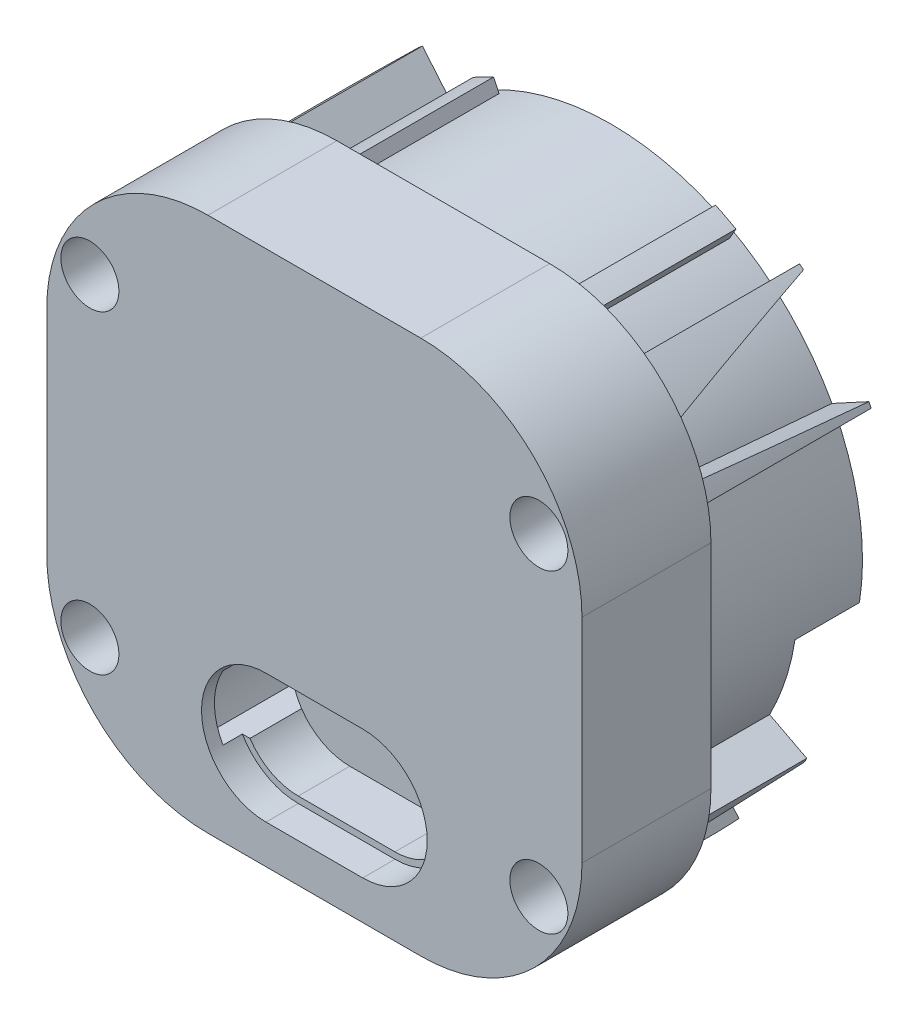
from build123d import *
from build123d.topology import SkipClean

# Parameters (mm, degrees)
BASE_EXTRUSION_DEPTH         = 20
ESQUISSE29_R                 = 4.5
ENL_V_MAT_EXTRU_1_DEPTH      = 14
ESQUISSE30_R                 = 2.5
ENL_V_MAT_EXTRU_2_DEPTH      = 61.336556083
ENL_V_MAT_EXTRU_3_DEPTH      = 5
ENL_V_MAT_EXTRU_4_DEPTH      = 13
ESQUISSE33_R                 = 5
ENL_V_MAT_EXTRU_5_DEPTH      = 61.112394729
ESQUISSE9_R                  = 39
BOSS_EXTRU_2_DEPTH           = 26
BOSS_EXTRU_3_DEPTH           = 25
ENL_V_START                  = -26
ESQUISSE34_R                 = 35
ENL_V_MAT_EXTRU_6_DEPTH      = 26
ESQUISSE35_R                 = 19
ESQUISSE35_R_2               = 15
BOSS_EXTRU_4_DEPTH           = 10
ENL_V_START_2                = -44
ENL_V_MAT_EXTRU_7_DEPTH      = 44
ENL_V_START_3                = -15
ENL_V_MAT_EXTRU_8_DEPTH      = 15
R_P_TITION_CIRCULAIRE1_COUNT = 6
R_P_TITION_CIRCULAIRE1_ANGLE = 225
ESQUISSE39_W                 = 38.5
ESQUISSE39_H                 = 35.5
ENL_V_MAT_EXTRU_9_DEPTH      = 10
BOSS_EXTRU_8_DEPTH           = 26
BOSS_EXTRU_9_DEPTH           = 16
ESQUISSE46_R                 = 10
ENL_V_MAT_EXTRU_10_DEPTH     = 15


with BuildPart() as part:
    # Esquisse1 → Base-Extrusion (new body)
    with BuildSketch(Plane.XY):
        with BuildLine():
            Line((-16.5, 41.5), (16.5, 41.5))
            ThreePointArc((16.5, 41.5), (34.17766953, 34.17766953), (41.5, 16.5))
            Line((41.5, 16.5), (41.5, -16.5))
            ThreePointArc((41.5, -16.5), (34.17766953, -34.17766953), (16.5, -41.5))
            Line((16.5, -41.5), (-16.5, -41.5))
            ThreePointArc((-16.5, -41.5), (-34.17766953, -34.17766953), (-41.5, -16.5))
            Line((-41.5, -16.5), (-41.5, 16.5))
            ThreePointArc((-41.5, 16.5), (-34.17766953, 34.17766953), (-16.5, 41.5))
        make_face()
    extrude(amount=BASE_EXTRUSION_DEPTH)

    # Esquisse29 → Enl_v. mat.-Extru.1 (cut)
    with BuildSketch(Plane(origin=(-0.101718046, 30.860947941, 20), x_dir=(1, 0, 0), z_dir=(0, 0, 1))):
        with Locations((34.915679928, -6.483949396)):
            Circle(ESQUISSE29_R)
        with Locations((34.915679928, -55.237946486)):
            Circle(ESQUISSE29_R)
        with Locations((-34.712243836, -55.237946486)):
            Circle(ESQUISSE29_R)
        with Locations((-34.712243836, -6.483949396)):
            Circle(ESQUISSE29_R)
    extrude(amount=-ENL_V_MAT_EXTRU_1_DEPTH, mode=Mode.SUBTRACT)

    # Esquisse30 → Enl_v. mat.-Extru.2 (cut, through all)
    with BuildSketch(Plane.XY.offset(6)):
        with Locations((34.813961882, 24.376998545)):
            Circle(ESQUISSE30_R)
        with Locations((-34.813961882, 24.376998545)):
            Circle(ESQUISSE30_R)
        with Locations((-34.813961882, -24.376998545)):
            Circle(ESQUISSE30_R)
        with Locations((34.813961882, -24.376998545)):
            Circle(ESQUISSE30_R)
    extrude(amount=-ENL_V_MAT_EXTRU_2_DEPTH, mode=Mode.SUBTRACT)

    # Esquisse31 → Enl_v. mat.-Extru.3 (cut)
    with BuildSketch(Plane.XY.offset(20)):
        with BuildLine():
            Line((-7.5, -35.5), (7.5, -35.5))
            ThreePointArc((7.5, -35.5), (17.5, -25.5), (7.5, -15.5))
            Line((7.5, -15.5), (-7.5, -15.5))
            ThreePointArc((-7.5, -15.5), (-17.5, -25.5), (-7.5, -35.5))
        make_face()
    extrude(amount=-ENL_V_MAT_EXTRU_3_DEPTH, mode=Mode.SUBTRACT)

    # Esquisse32 → Enl_v. mat.-Extru.4 (cut)
    with BuildSketch(Plane.XY.offset(20)):
        with BuildLine():
            Line((-7.5, -34.5), (7.5, -34.5))
            ThreePointArc((7.5, -34.5), (16.5, -25.5), (7.5, -16.5))
            Line((7.5, -16.5), (-7.5, -16.5))
            ThreePointArc((-7.5, -16.5), (-16.5, -25.5), (-7.5, -34.5))
        make_face()
    extrude(amount=-ENL_V_MAT_EXTRU_4_DEPTH, mode=Mode.SUBTRACT)

    # Esquisse33 → Enl_v. mat.-Extru.5 (cut, through all)
    with BuildSketch(Plane.XY.offset(7)):
        with Locations((7.5, -25.5)):
            Circle(ESQUISSE33_R)
    extrude(amount=-ENL_V_MAT_EXTRU_5_DEPTH, mode=Mode.SUBTRACT)

    # Esquisse9 → Boss.-Extru.2 (add)
    with BuildSketch(Plane(origin=(0, 0, 0), x_dir=(-1, 0, 0), z_dir=(0, 0, -1))):
        with Locations(Location((0, 0, 0), (0, 0, 180))):
            Circle(ESQUISSE9_R)
    extrude(amount=BOSS_EXTRU_2_DEPTH)

    # Esquisse28 → Boss.-Extru.3 (add)
    with BuildSketch(Plane(origin=(0, 0, 0), x_dir=(-1, 0, 0), z_dir=(0, 0, -1))):
        with BuildLine():
            Line((16.363401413, 35.401117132), (17.202550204, 37.216559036))
            ThreePointArc((17.202550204, 37.216559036), (18.809540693, 36.430772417), (20.380726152, 35.575637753))
            Line((20.380726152, 35.575637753), (19.386544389, 33.840240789))
            ThreePointArc((19.386544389, 33.840240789), (17.892002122, 34.653661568), (16.363401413, 35.401117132))
        make_face()
        with BuildLine():
            Line((-19.386544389, 33.840240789), (-20.380726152, 35.575637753))
            ThreePointArc((-20.380726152, 35.575637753), (-18.809540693, 36.430772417), (-17.202550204, 37.216559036))
            Line((-17.202550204, 37.216559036), (-16.363401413, 35.401117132))
            ThreePointArc((-16.363401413, 35.401117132), (-17.892002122, 34.653661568), (-19.386544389, 33.840240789))
        make_face()
    extrude(amount=BOSS_EXTRU_3_DEPTH)

    # Esquisse34 → Enl_v. mat.-Extru.6 (cut)
    with BuildSketch(Plane(origin=(0, 0, -26), x_dir=(-1, 0, 0), z_dir=(0, 0, -1)).offset(ENL_V_START)):
        Circle(ESQUISSE34_R)
    extrude(amount=ENL_V_MAT_EXTRU_6_DEPTH, mode=Mode.SUBTRACT)

    # Esquisse35 → Boss.-Extru.4 (add)
    with BuildSketch(Plane(origin=(0, 0, 0), x_dir=(-1, 0, 0), z_dir=(0, 0, -1))):
        Circle(ESQUISSE35_R)
        Circle(ESQUISSE35_R_2, mode=Mode.SUBTRACT)
    extrude(amount=BOSS_EXTRU_4_DEPTH)

    # Esquisse37 → Enl_v. mat.-Extru.7 (cut)
    with BuildSketch(Plane(origin=(0, 0, -26), x_dir=(-1, 0, 0), z_dir=(0, 0, -1)).offset(ENL_V_START_2)):
        with BuildLine():
            Line((14.983314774, -20.5), (18.956439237, -20.5))
            ThreePointArc((18.956439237, -20.5), (20, -25.5), (18.956439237, -30.5))
            Line((18.956439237, -30.5), (14.983314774, -30.5))
            ThreePointArc((14.983314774, -30.5), (16.5, -25.5), (14.983314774, -20.5))
        make_face()
    extrude(amount=ENL_V_MAT_EXTRU_7_DEPTH, mode=Mode.SUBTRACT)

    # Esquisse38 → Enl_v. mat.-Extru.8 (cut)
    with BuildSketch(Plane(origin=(0, 0, 0), x_dir=(-1, 0, 0), z_dir=(0, 0, -1)).offset(ENL_V_START_3)):
        with BuildLine():
            Line((18.973665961, -1), (34.985711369, -1))
            ThreePointArc((34.985711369, -1), (32.335783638, -13.393920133), (25.445740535, -24.031526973))
            Line((25.445740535, -24.031526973), (14.123514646, -12.709301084))
            ThreePointArc((14.123514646, -12.709301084), (17.553711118, -7.270985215), (18.973665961, -1))
        make_face()
    enl_v_mat_extru_8 = extrude(amount=ENL_V_MAT_EXTRU_8_DEPTH, mode=Mode.SUBTRACT)

    # R_p_tition circulaire1: Enl_v. mat.-Extru.8 ×6 about axis
    with SkipClean():  # the faces are left unmerged after this step: merging them gives an invalid solid
        r_p_tition_circulaire1_axis = Axis((0, 0, 0), (0, 0, -1))
        for i in range(1, R_P_TITION_CIRCULAIRE1_COUNT):
            add(enl_v_mat_extru_8.rotate(r_p_tition_circulaire1_axis, i * R_P_TITION_CIRCULAIRE1_ANGLE / (R_P_TITION_CIRCULAIRE1_COUNT - 1)), mode=Mode.SUBTRACT)

    # Esquisse39 → Enl_v. mat.-Extru.9 (cut)
    with SkipClean():  # the faces are left unmerged after this step: merging them gives an invalid solid
        with BuildSketch(Plane(origin=(0, 0, -26), x_dir=(-1, 0, 0), z_dir=(0, 0, -1))):
            with Locations((-22.25, -23.75)):
                Rectangle(ESQUISSE39_W, ESQUISSE39_H)
        extrude(amount=-ENL_V_MAT_EXTRU_9_DEPTH, mode=Mode.SUBTRACT)

    # Esquisse40 → Boss.-Extru.8 (add)
    with SkipClean():  # the faces are left unmerged after this step: merging them gives an invalid solid
        with BuildSketch(Plane(origin=(0, 0, 0), x_dir=(-1, 0, 0), z_dir=(0, 0, -1))):
            with BuildLine():
                Line((25.068716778, 29.875733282), (29.246836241, 34.855022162))
                ThreePointArc((29.246836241, 34.855022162), (35.484743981, 28.479517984), (40.35899291, 21.009561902))
                Line((40.35899291, 21.009561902), (34.593422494, 18.008195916))
                ThreePointArc((34.593422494, 18.008195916), (30.415494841, 24.411015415), (25.068716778, 29.875733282))
            make_face()
            with BuildLine():
                Line((-25.068716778, 29.875733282), (-29.246836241, 34.855022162))
                ThreePointArc((-29.246836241, 34.855022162), (-35.484743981, 28.479517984), (-40.35899291, 21.009561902))
                Line((-40.35899291, 21.009561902), (-34.593422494, 18.008195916))
                ThreePointArc((-34.593422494, 18.008195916), (-30.415494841, 24.411015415), (-25.068716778, 29.875733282))
            make_face()
            with BuildLine():
                Line((34.593422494, -18.008195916), (40.35899291, -21.009561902))
                ThreePointArc((40.35899291, -21.009561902), (35.484743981, -28.479517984), (29.246836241, -34.855022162))
                Line((29.246836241, -34.855022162), (25.068716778, -29.875733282))
                ThreePointArc((25.068716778, -29.875733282), (30.415494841, -24.411015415), (34.593422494, -18.008195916))
            make_face()
        extrude(amount=BOSS_EXTRU_8_DEPTH)

    # Esquisse41 → Boss.-Extru.9 (add)
    with SkipClean():  # the faces are left unmerged after this step: merging them gives an invalid solid
        with BuildSketch(Plane(origin=(0, 0, 0), x_dir=(-1, 0, 0), z_dir=(0, 0, -1))):
            with BuildLine():
                Line((-40.35899291, -21.009561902), (-34.593422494, -18.008195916))
                ThreePointArc((-34.593422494, -18.008195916), (-30.415494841, -24.411015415), (-25.068716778, -29.875733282))
                Line((-25.068716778, -29.875733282), (-29.246836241, -34.855022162))
                ThreePointArc((-29.246836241, -34.855022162), (-35.484743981, -28.479517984), (-40.35899291, -21.009561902))
            make_face()
        extrude(amount=BOSS_EXTRU_9_DEPTH)

    # Esquisse42 for Enl_vement d → Enl_vement de mati_re-Lissage7 section 0
    with SkipClean():  # the faces are left unmerged after this step: merging them gives an invalid solid
        with BuildSketch(Plane(origin=(0, 0, -16), x_dir=(-1, 0, 0), z_dir=(0, 0, -1))):
            with BuildLine():
                Line((-34.273867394, -18.60919165), (-44.800622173, -24.324753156))
                # circular arc as an exact rational Bezier (weights 1, cos(half-angle), 1)
                Bezier((-44.800622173, -24.324753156), (-40.401990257, -32.426025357), (-33.444788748, -38.473828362), weights=[1, 0.984040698, 1])
                Line((-33.444788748, -38.473828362), (-25.586302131, -29.433673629))
                Bezier((-25.586302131, -29.433673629), (-30.908777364, -24.806916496), (-34.273867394, -18.60919165), weights=[1, 0.984040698, 1])
            make_face()
        # Esquisse43 for Enl_vement d → Enl_vement de mati_re-Lissage7 section 1
        with BuildSketch(Plane(origin=(0, 0, 0), x_dir=(-1, 0, 0), z_dir=(0, 0, -1))):
            with BuildLine():
                Line((-39.020638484, -23.401704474), (-33.446261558, -20.058603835))
                Bezier((-33.446261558, -20.058603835), (-32.026819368, -22.425420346), (-30.288217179, -24.56875862), weights=[1, 0.997505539, 1])
                Line((-30.288217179, -24.56875862), (-35.336253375, -28.663551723))
                Bezier((-35.336253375, -28.663551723), (-37.364622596, -26.162990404), (-39.020638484, -23.401704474), weights=[1, 0.997505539, 1])
            make_face()
        loft(mode=Mode.SUBTRACT)

    # Esquisse44 for Enl_vement d → Enl_vement de mati_re-Lissage8 section 0
    with SkipClean():  # the faces are left unmerged after this step: merging them gives an invalid solid
        with BuildSketch(Plane(origin=(0, 0, -26), x_dir=(-1, 0, 0), z_dir=(0, 0, -1))):
            with BuildLine():
                Line((32.517163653, 37.406717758), (25.586302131, 29.433673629))
                Bezier((25.586302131, 29.433673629), (30.908777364, 24.806916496), (34.273867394, 18.60919165), weights=[1, 0.984040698, 1])
                Line((34.273867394, 18.60919165), (43.558031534, 23.650081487))
                Bezier((43.558031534, 23.650081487), (39.28140013, 31.526656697), (32.517163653, 37.406717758), weights=[1, 0.984040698, 1])
            make_face()
        # Esquisse45 for Enl_vement d → Enl_vement de mati_re-Lissage8 section 1
        with BuildSketch(Plane(origin=(0, 0, 0), x_dir=(-1, 0, 0), z_dir=(0, 0, -1))):
            with BuildLine():
                Line((30.288217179, 24.56875862), (35.336253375, 28.663551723))
                Bezier((35.336253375, 28.663551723), (37.364622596, 26.162990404), (39.020638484, 23.401704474), weights=[1, 0.997505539, 1])
                Line((39.020638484, 23.401704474), (33.446261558, 20.058603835))
                Bezier((33.446261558, 20.058603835), (32.026819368, 22.425420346), (30.288217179, 24.56875862), weights=[1, 0.997505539, 1])
            make_face()
        enl_vement_de_mati_re_lissage8 = loft(mode=Mode.SUBTRACT)

    # Sym_trie1: Enl_vement de mati_re-Lissage8 across plane
    with SkipClean():  # the faces are left unmerged after this step: merging them gives an invalid solid
        add(enl_vement_de_mati_re_lissage8.mirror(Plane.ZX), mode=Mode.SUBTRACT)

    # Sym_trie2: Enl_vement de mati_re-Lissage8 across plane
    with SkipClean():  # the faces are left unmerged after this step: merging them gives an invalid solid
        add(enl_vement_de_mati_re_lissage8.mirror(Plane(origin=(0, 0, 0), x_dir=(0, 0, 1), z_dir=(1, 0, 0))), mode=Mode.SUBTRACT)

    # Esquisse46 → Enl_v. mat.-Extru.10 (cut)
    with SkipClean():  # the faces are left unmerged after this step: merging them gives an invalid solid
        with BuildSketch(Plane(origin=(0, 0, 0), x_dir=(-1, 0, 0), z_dir=(0, 0, -1))):
            Circle(ESQUISSE46_R)
        extrude(amount=-ENL_V_MAT_EXTRU_10_DEPTH, mode=Mode.SUBTRACT)


solid = part.part
